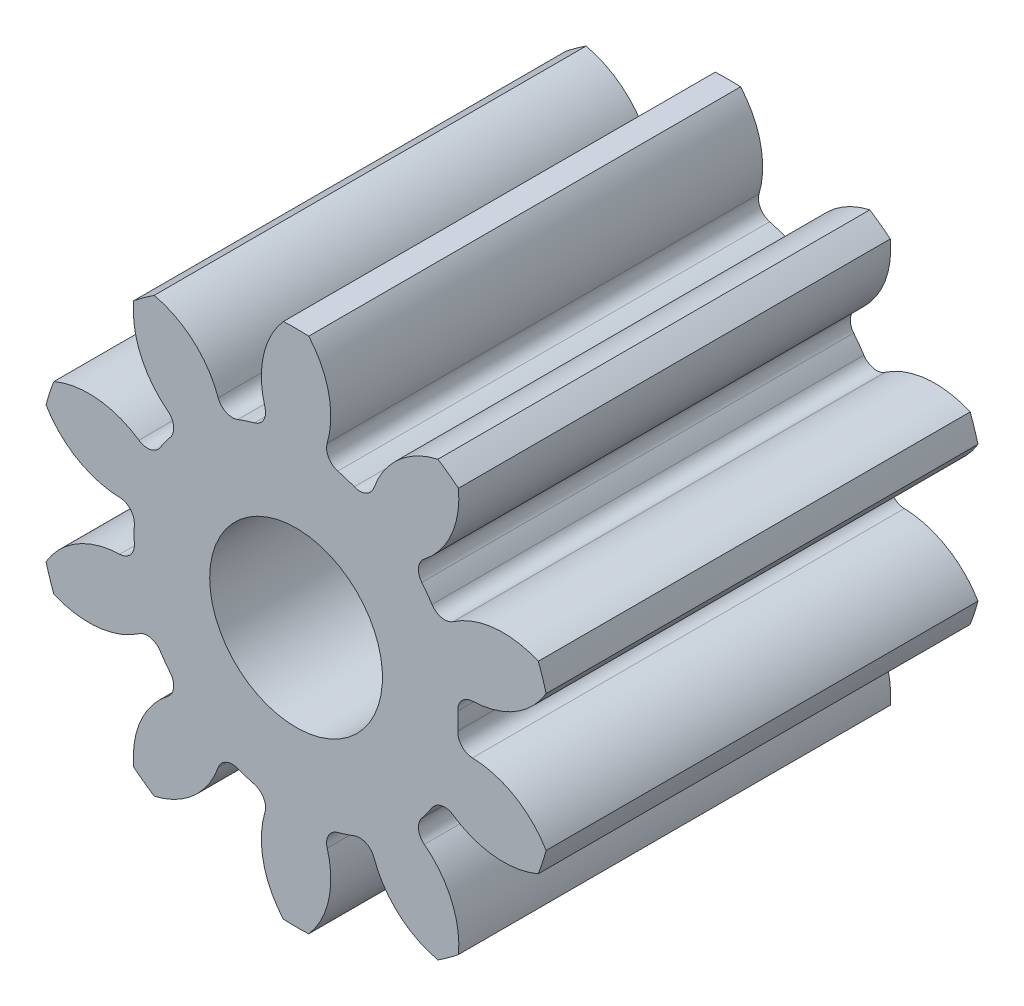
from build123d import *

# Parameters (mm, degrees)
BOSS_EXTRU_1_DEPTH                 = 5
CONG_1_R                           = 0.175
R_P_TITION_CIRCULAIRE4_COUNT       = 10
CONG_1_OF_R_P_TITION_CIRCULAIRE4_R = 0.175
ESQUISSE6_R                        = 1
ENL_V_MAT_EXTRU_1_DEPTH            = 8.479426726


with BuildPart() as part:
    # Esquisse3 → Boss.-Extru.1 (new body)
    with BuildSketch(Plane.XY):
        with BuildLine():
            Line((-1.958113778, 1.222878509), (-1.378706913, -0.560352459))
            Line((-1.378706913, -0.560352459), (-0.799300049, 1.222878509))
            ThreePointArc((-0.799300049, 1.222878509), (-0.942925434, 1.263303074), (-1.089310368, 1.292179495))
            ThreePointArc((-1.089310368, 1.292179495), (-0.984517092, 1.886051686), (-1.231837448, 2.436050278))
            ThreePointArc((-1.231837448, 2.436050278), (-1.378706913, 2.439647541), (-1.525576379, 2.436050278))
            ThreePointArc((-1.525576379, 2.436050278), (-1.772896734, 1.886051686), (-1.668103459, 1.292179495))
            ThreePointArc((-1.668103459, 1.292179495), (-1.814488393, 1.263303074), (-1.958113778, 1.222878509))
        make_face()
    boss_extru_1 = extrude(amount=BOSS_EXTRU_1_DEPTH)

    # Cong_1
    cong_1_edges = [part.edges().sort_by_distance(p)[0] for p in [
        (-1.668103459, 1.292179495, 2.5),
        (-1.089310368, 1.292179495, 2.5),
    ]]
    fillet(cong_1_edges, radius=CONG_1_R)

    # R_p_tition circulaire4: Boss.-Extru.1 ×10 about axis
    r_p_tition_circulaire4_axis = Axis((-1.378706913, -0.560352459, 0), (0, 0, 1))
    for i in range(1, R_P_TITION_CIRCULAIRE4_COUNT):
        add(boss_extru_1.rotate(r_p_tition_circulaire4_axis, i * 360 / R_P_TITION_CIRCULAIRE4_COUNT))

    # Cong_1 of R_p_tition circulaire4
    cong_1_of_r_p_tition_circulaire4_edges = [part.edges().sort_by_distance(p)[0] for p in [
        (-2.701724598, 0.768274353, 2.5),
        (-2.233471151, 1.108480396, 2.5),
        (-3.22999795, -0.263121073, 2.5),
        (-3.051141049, 0.287343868, 2.5),
        (-3.051141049, -1.408048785, 2.5),
        (-3.22999795, -0.857583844, 2.5),
        (-2.233471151, -2.229185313, 2.5),
        (-2.701724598, -1.88897927, 2.5),
        (-1.089310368, -2.412884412, 2.5),
        (-1.668103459, -2.412884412, 2.5),
        (-0.055689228, -1.88897927, 2.5),
        (-0.523942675, -2.229185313, 2.5),
        (0.472584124, -0.857583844, 2.5),
        (0.293727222, -1.408048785, 2.5),
        (0.293727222, 0.287343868, 2.5),
        (0.472584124, -0.263121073, 2.5),
        (-0.523942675, 1.108480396, 2.5),
        (-0.055689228, 0.768274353, 2.5),
    ]]
    fillet(cong_1_of_r_p_tition_circulaire4_edges, radius=CONG_1_OF_R_P_TITION_CIRCULAIRE4_R)

    # Esquisse6 → Enl_v. mat.-Extru.1 (cut, through all)
    with BuildSketch(Plane(origin=(0, 0, 0), x_dir=(-1, 0, 0), z_dir=(0, 0, -1))):
        with Locations((1.378706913, -0.560352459)):
            Circle(ESQUISSE6_R)
    extrude(amount=-ENL_V_MAT_EXTRU_1_DEPTH, mode=Mode.SUBTRACT)


solid = part.part
